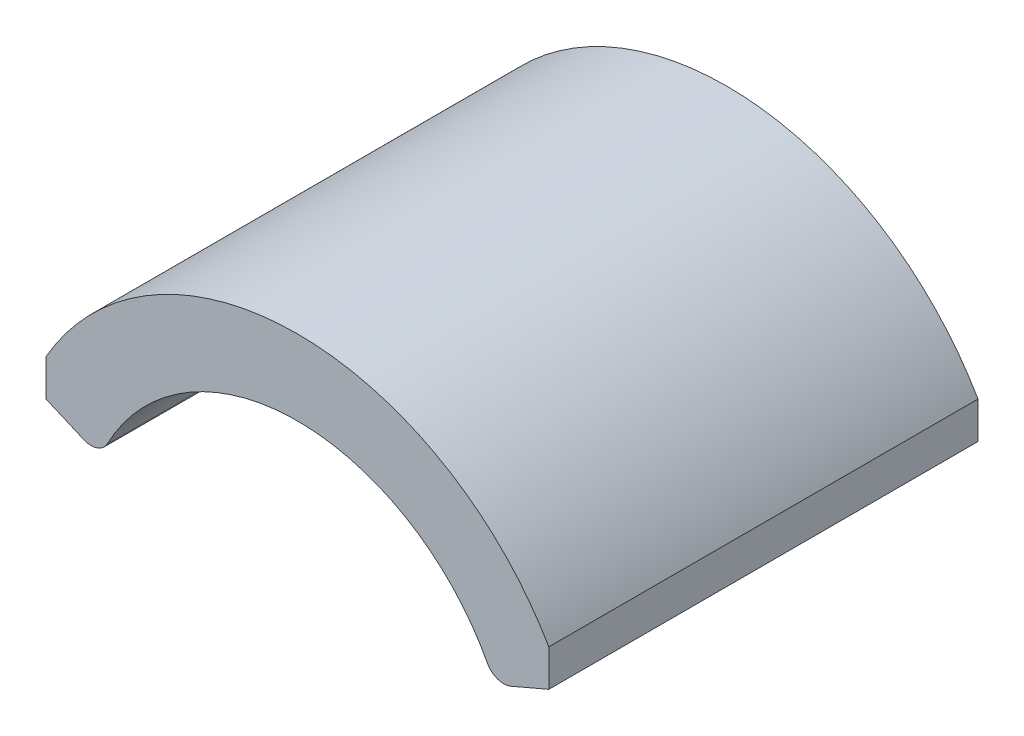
ISO-10303-21;
HEADER;
FILE_DESCRIPTION(('STEP AP214'),'2;1');
FILE_NAME('part.step','',(''),(''),'','','');
FILE_SCHEMA(('AUTOMOTIVE_DESIGN { 1 0 10303 214 1 1 1 1 }'));
ENDSEC;
DATA;
#1=APPLICATION_CONTEXT('core data for automotive mechanical design processes');
#2=APPLICATION_PROTOCOL_DEFINITION('international standard','automotive_design',2000,#1);
#3=PRODUCT_CONTEXT('',#1,'mechanical');
#4=PRODUCT('Part','Part','',(#3));
#5=PRODUCT_RELATED_PRODUCT_CATEGORY('part','',(#4));
#6=PRODUCT_DEFINITION_FORMATION('','',#4);
#7=PRODUCT_DEFINITION_CONTEXT('part definition',#1,'design');
#8=PRODUCT_DEFINITION('design','',#6,#7);
#9=PRODUCT_DEFINITION_SHAPE('','',#8);
#10=(LENGTH_UNIT() NAMED_UNIT(*) SI_UNIT(.MILLI.,.METRE.));
#11=(NAMED_UNIT(*) PLANE_ANGLE_UNIT() SI_UNIT($,.RADIAN.));
#12=(NAMED_UNIT(*) SI_UNIT($,.STERADIAN.) SOLID_ANGLE_UNIT());
#13=UNCERTAINTY_MEASURE_WITH_UNIT(LENGTH_MEASURE(1.E-05),#10,'distance_accuracy_value','');
#14=(GEOMETRIC_REPRESENTATION_CONTEXT(3) GLOBAL_UNCERTAINTY_ASSIGNED_CONTEXT((#13)) GLOBAL_UNIT_ASSIGNED_CONTEXT((#10,
#11,#12)) REPRESENTATION_CONTEXT('',''));
#15=CARTESIAN_POINT('',(0.,0.,0.));
#16=DIRECTION('',(0.,0.,1.));
#17=DIRECTION('',(1.,0.,0.));
#18=AXIS2_PLACEMENT_3D('',#15,#16,#17);
#19=CARTESIAN_POINT('',(0.,24.7771123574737,-50.));
#20=DIRECTION('',(0.,0.,1.));
#21=DIRECTION('',(1.,0.,0.));
#22=AXIS2_PLACEMENT_3D('',#19,#20,#21);
#23=CYLINDRICAL_SURFACE('',#22,23.6500000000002);
#24=CARTESIAN_POINT('',(0.,24.7771123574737,-15.));
#25=DIRECTION('',(0.,0.,1.));
#26=DIRECTION('',(1.,0.,0.));
#27=AXIS2_PLACEMENT_3D('',#24,#25,#26);
#28=CIRCLE('',#27,23.6500000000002);
#29=CARTESIAN_POINT('',(20.5,36.5700127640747,-15.));
#30=VERTEX_POINT('',#29);
#31=CARTESIAN_POINT('',(-20.5,36.5700127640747,-15.));
#32=VERTEX_POINT('',#31);
#33=EDGE_CURVE('E93',#30,#32,#28,.T.);
#34=ORIENTED_EDGE('',*,*,#33,.F.);
#35=DIRECTION('',(0.,0.,1.));
#36=VECTOR('',#35,1.);
#37=CARTESIAN_POINT('',(20.5,36.5700127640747,-50.));
#38=LINE('',#37,#36);
#39=CARTESIAN_POINT('',(20.5,36.5700127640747,-50.));
#40=VERTEX_POINT('',#39);
#41=EDGE_CURVE('E11',#40,#30,#38,.T.);
#42=ORIENTED_EDGE('',*,*,#41,.F.);
#43=CARTESIAN_POINT('',(0.,24.7771123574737,-50.));
#44=DIRECTION('',(0.,0.,1.));
#45=DIRECTION('',(1.,0.,0.));
#46=AXIS2_PLACEMENT_3D('',#43,#44,#45);
#47=CIRCLE('',#46,23.6500000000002);
#48=CARTESIAN_POINT('',(-20.5,36.5700127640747,-50.));
#49=VERTEX_POINT('',#48);
#50=EDGE_CURVE('E95',#40,#49,#47,.T.);
#51=ORIENTED_EDGE('',*,*,#50,.T.);
#52=DIRECTION('',(0.,0.,1.));
#53=VECTOR('',#52,1.);
#54=CARTESIAN_POINT('',(-20.5,36.5700127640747,-50.));
#55=LINE('',#54,#53);
#56=EDGE_CURVE('E32',#49,#32,#55,.T.);
#57=ORIENTED_EDGE('',*,*,#56,.T.);
#58=EDGE_LOOP('',(#34,#42,#51,#57));
#59=FACE_BOUND('',#58,.T.);
#60=ADVANCED_FACE('F29',(#59),#23,.T.);
#61=CARTESIAN_POINT('',(20.5,36.5700127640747,-50.));
#62=DIRECTION('',(1.,0.,0.));
#63=DIRECTION('',(0.,0.,-1.));
#64=AXIS2_PLACEMENT_3D('',#61,#62,#63);
#65=PLANE('',#64);
#66=DIRECTION('',(0.,1.,0.));
#67=VECTOR('',#66,1.);
#68=CARTESIAN_POINT('',(20.5,36.5700127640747,-15.));
#69=LINE('',#68,#67);
#70=CARTESIAN_POINT('',(20.5,33.5698113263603,-15.));
#71=VERTEX_POINT('',#70);
#72=EDGE_CURVE('E111',#71,#30,#69,.T.);
#73=ORIENTED_EDGE('',*,*,#72,.F.);
#74=DIRECTION('',(0.,0.,1.));
#75=VECTOR('',#74,1.);
#76=CARTESIAN_POINT('',(20.5,33.5698113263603,-50.));
#77=LINE('',#76,#75);
#78=CARTESIAN_POINT('',(20.5,33.5698113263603,-50.));
#79=VERTEX_POINT('',#78);
#80=EDGE_CURVE('E37',#79,#71,#77,.T.);
#81=ORIENTED_EDGE('',*,*,#80,.F.);
#82=DIRECTION('',(0.,1.,0.));
#83=VECTOR('',#82,1.);
#84=CARTESIAN_POINT('',(20.5,36.5700127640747,-50.));
#85=LINE('',#84,#83);
#86=EDGE_CURVE('E100',#79,#40,#85,.T.);
#87=ORIENTED_EDGE('',*,*,#86,.T.);
#88=ORIENTED_EDGE('',*,*,#41,.T.);
#89=EDGE_LOOP('',(#73,#81,#87,#88));
#90=FACE_BOUND('',#89,.T.);
#91=ADVANCED_FACE('F172',(#90),#65,.T.);
#92=CARTESIAN_POINT('',(17.4070993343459,32.2432286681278,-50.));
#93=DIRECTION('',(0.394183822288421,-0.919031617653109,0.));
#94=DIRECTION('',(0.919031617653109,0.394183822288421,0.));
#95=AXIS2_PLACEMENT_3D('',#92,#93,#94);
#96=PLANE('',#95);
#97=DIRECTION('',(0.919031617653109,0.394183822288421,0.));
#98=VECTOR('',#97,1.);
#99=CARTESIAN_POINT('',(17.4070993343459,32.2432286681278,-15.));
#100=LINE('',#99,#98);
#101=CARTESIAN_POINT('',(17.4070993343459,32.2432286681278,-15.));
#102=VERTEX_POINT('',#101);
#103=EDGE_CURVE('E124',#102,#71,#100,.T.);
#104=ORIENTED_EDGE('',*,*,#103,.F.);
#105=DIRECTION('',(0.,0.,1.));
#106=VECTOR('',#105,1.);
#107=CARTESIAN_POINT('',(17.4070993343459,32.2432286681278,-50.));
#108=LINE('',#107,#106);
#109=CARTESIAN_POINT('',(17.4070993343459,32.2432286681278,-50.));
#110=VERTEX_POINT('',#109);
#111=EDGE_CURVE('E146',#110,#102,#108,.T.);
#112=ORIENTED_EDGE('',*,*,#111,.F.);
#113=DIRECTION('',(0.919031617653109,0.394183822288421,0.));
#114=VECTOR('',#113,1.);
#115=CARTESIAN_POINT('',(17.4070993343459,32.2432286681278,-50.));
#116=LINE('',#115,#114);
#117=EDGE_CURVE('E142',#110,#79,#116,.T.);
#118=ORIENTED_EDGE('',*,*,#117,.T.);
#119=ORIENTED_EDGE('',*,*,#80,.T.);
#120=EDGE_LOOP('',(#104,#112,#118,#119));
#121=FACE_BOUND('',#120,.T.);
#122=ADVANCED_FACE('F171',(#121),#96,.T.);
#123=CARTESIAN_POINT('',(16.8158236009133,33.6217760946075,-50.));
#124=DIRECTION('',(0.,0.,1.));
#125=DIRECTION('',(1.,0.,0.));
#126=AXIS2_PLACEMENT_3D('',#123,#124,#125);
#127=CYLINDRICAL_SURFACE('',#126,1.5);
#128=CARTESIAN_POINT('',(16.8158236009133,33.6217760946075,-15.));
#129=DIRECTION('',(0.,0.,1.));
#130=DIRECTION('',(1.,0.,0.));
#131=AXIS2_PLACEMENT_3D('',#128,#129,#130);
#132=CIRCLE('',#131,1.5);
#133=CARTESIAN_POINT('',(15.4882585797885,32.9235131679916,-15.));
#134=VERTEX_POINT('',#133);
#135=EDGE_CURVE('E121',#134,#102,#132,.T.);
#136=ORIENTED_EDGE('',*,*,#135,.F.);
#137=DIRECTION('',(0.,0.,1.));
#138=VECTOR('',#137,1.);
#139=CARTESIAN_POINT('',(15.4882585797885,32.9235131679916,-50.));
#140=LINE('',#139,#138);
#141=CARTESIAN_POINT('',(15.4882585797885,32.9235131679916,-50.));
#142=VERTEX_POINT('',#141);
#143=EDGE_CURVE('E148',#142,#134,#140,.T.);
#144=ORIENTED_EDGE('',*,*,#143,.F.);
#145=CARTESIAN_POINT('',(16.8158236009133,33.6217760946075,-50.));
#146=DIRECTION('',(0.,0.,1.));
#147=DIRECTION('',(1.,0.,0.));
#148=AXIS2_PLACEMENT_3D('',#145,#146,#147);
#149=CIRCLE('',#148,1.5);
#150=EDGE_CURVE('E139',#142,#110,#149,.T.);
#151=ORIENTED_EDGE('',*,*,#150,.T.);
#152=ORIENTED_EDGE('',*,*,#111,.T.);
#153=EDGE_LOOP('',(#136,#144,#151,#152));
#154=FACE_BOUND('',#153,.T.);
#155=ADVANCED_FACE('F167',(#154),#127,.T.);
#156=CARTESIAN_POINT('',(0.,24.7771123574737,-50.));
#157=DIRECTION('',(0.,0.,1.));
#158=DIRECTION('',(1.,0.,0.));
#159=AXIS2_PLACEMENT_3D('',#156,#157,#158);
#160=CYLINDRICAL_SURFACE('',#159,17.5);
#161=CARTESIAN_POINT('',(0.,24.7771123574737,-15.));
#162=DIRECTION('',(0.,0.,-1.));
#163=DIRECTION('',(1.,0.,0.));
#164=AXIS2_PLACEMENT_3D('',#161,#162,#163);
#165=CIRCLE('',#164,17.5);
#166=CARTESIAN_POINT('',(-15.4882585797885,32.9235131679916,-15.));
#167=VERTEX_POINT('',#166);
#168=EDGE_CURVE('E118',#167,#134,#165,.T.);
#169=ORIENTED_EDGE('',*,*,#168,.F.);
#170=DIRECTION('',(0.,0.,1.));
#171=VECTOR('',#170,1.);
#172=CARTESIAN_POINT('',(-15.4882585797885,32.9235131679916,-50.));
#173=LINE('',#172,#171);
#174=CARTESIAN_POINT('',(-15.4882585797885,32.9235131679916,-50.));
#175=VERTEX_POINT('',#174);
#176=EDGE_CURVE('E150',#175,#167,#173,.T.);
#177=ORIENTED_EDGE('',*,*,#176,.F.);
#178=CARTESIAN_POINT('',(0.,24.7771123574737,-50.));
#179=DIRECTION('',(0.,0.,-1.));
#180=DIRECTION('',(1.,0.,0.));
#181=AXIS2_PLACEMENT_3D('',#178,#179,#180);
#182=CIRCLE('',#181,17.5);
#183=EDGE_CURVE('E136',#175,#142,#182,.T.);
#184=ORIENTED_EDGE('',*,*,#183,.T.);
#185=ORIENTED_EDGE('',*,*,#143,.T.);
#186=EDGE_LOOP('',(#169,#177,#184,#185));
#187=FACE_BOUND('',#186,.T.);
#188=ADVANCED_FACE('F163',(#187),#160,.F.);
#189=CARTESIAN_POINT('',(-16.8158236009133,33.6217760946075,-50.));
#190=DIRECTION('',(0.,0.,1.));
#191=DIRECTION('',(1.,0.,0.));
#192=AXIS2_PLACEMENT_3D('',#189,#190,#191);
#193=CYLINDRICAL_SURFACE('',#192,1.5);
#194=CARTESIAN_POINT('',(-16.8158236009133,33.6217760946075,-15.));
#195=DIRECTION('',(0.,0.,1.));
#196=DIRECTION('',(-1.,0.,0.));
#197=AXIS2_PLACEMENT_3D('',#194,#195,#196);
#198=CIRCLE('',#197,1.5);
#199=CARTESIAN_POINT('',(-17.4070993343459,32.2432286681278,-15.));
#200=VERTEX_POINT('',#199);
#201=EDGE_CURVE('E115',#200,#167,#198,.T.);
#202=ORIENTED_EDGE('',*,*,#201,.F.);
#203=DIRECTION('',(0.,0.,1.));
#204=VECTOR('',#203,1.);
#205=CARTESIAN_POINT('',(-17.4070993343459,32.2432286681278,-50.));
#206=LINE('',#205,#204);
#207=CARTESIAN_POINT('',(-17.4070993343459,32.2432286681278,-50.));
#208=VERTEX_POINT('',#207);
#209=EDGE_CURVE('E152',#208,#200,#206,.T.);
#210=ORIENTED_EDGE('',*,*,#209,.F.);
#211=CARTESIAN_POINT('',(-16.8158236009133,33.6217760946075,-50.));
#212=DIRECTION('',(0.,0.,1.));
#213=DIRECTION('',(-1.,0.,0.));
#214=AXIS2_PLACEMENT_3D('',#211,#212,#213);
#215=CIRCLE('',#214,1.5);
#216=EDGE_CURVE('E133',#208,#175,#215,.T.);
#217=ORIENTED_EDGE('',*,*,#216,.T.);
#218=ORIENTED_EDGE('',*,*,#176,.T.);
#219=EDGE_LOOP('',(#202,#210,#217,#218));
#220=FACE_BOUND('',#219,.T.);
#221=ADVANCED_FACE('F159',(#220),#193,.T.);
#222=CARTESIAN_POINT('',(-17.4070993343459,32.2432286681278,-50.));
#223=DIRECTION('',(-0.394183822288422,-0.919031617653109,0.));
#224=DIRECTION('',(0.919031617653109,-0.394183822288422,0.));
#225=AXIS2_PLACEMENT_3D('',#222,#223,#224);
#226=PLANE('',#225);
#227=DIRECTION('',(0.919031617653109,-0.394183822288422,0.));
#228=VECTOR('',#227,1.);
#229=CARTESIAN_POINT('',(-17.4070993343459,32.2432286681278,-15.));
#230=LINE('',#229,#228);
#231=CARTESIAN_POINT('',(-20.5,33.5698113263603,-15.));
#232=VERTEX_POINT('',#231);
#233=EDGE_CURVE('E107',#232,#200,#230,.T.);
#234=ORIENTED_EDGE('',*,*,#233,.F.);
#235=DIRECTION('',(0.,0.,1.));
#236=VECTOR('',#235,1.);
#237=CARTESIAN_POINT('',(-20.5,33.5698113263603,-50.));
#238=LINE('',#237,#236);
#239=CARTESIAN_POINT('',(-20.5,33.5698113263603,-50.));
#240=VERTEX_POINT('',#239);
#241=EDGE_CURVE('E99',#240,#232,#238,.T.);
#242=ORIENTED_EDGE('',*,*,#241,.F.);
#243=DIRECTION('',(0.919031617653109,-0.394183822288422,0.));
#244=VECTOR('',#243,1.);
#245=CARTESIAN_POINT('',(-17.4070993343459,32.2432286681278,-50.));
#246=LINE('',#245,#244);
#247=EDGE_CURVE('E130',#240,#208,#246,.T.);
#248=ORIENTED_EDGE('',*,*,#247,.T.);
#249=ORIENTED_EDGE('',*,*,#209,.T.);
#250=EDGE_LOOP('',(#234,#242,#248,#249));
#251=FACE_BOUND('',#250,.T.);
#252=ADVANCED_FACE('F155',(#251),#226,.T.);
#253=CARTESIAN_POINT('',(-20.5,36.5700127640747,-50.));
#254=DIRECTION('',(-1.,0.,0.));
#255=DIRECTION('',(0.,-1.,0.));
#256=AXIS2_PLACEMENT_3D('',#253,#254,#255);
#257=PLANE('',#256);
#258=DIRECTION('',(0.,-1.,0.));
#259=VECTOR('',#258,1.);
#260=CARTESIAN_POINT('',(-20.5,36.5700127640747,-15.));
#261=LINE('',#260,#259);
#262=EDGE_CURVE('E102',#32,#232,#261,.T.);
#263=ORIENTED_EDGE('',*,*,#262,.F.);
#264=ORIENTED_EDGE('',*,*,#56,.F.);
#265=DIRECTION('',(0.,-1.,0.));
#266=VECTOR('',#265,1.);
#267=CARTESIAN_POINT('',(-20.5,36.5700127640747,-50.));
#268=LINE('',#267,#266);
#269=EDGE_CURVE('E128',#49,#240,#268,.T.);
#270=ORIENTED_EDGE('',*,*,#269,.T.);
#271=ORIENTED_EDGE('',*,*,#241,.T.);
#272=EDGE_LOOP('',(#263,#264,#270,#271));
#273=FACE_BOUND('',#272,.T.);
#274=ADVANCED_FACE('F103',(#273),#257,.T.);
#275=CARTESIAN_POINT('',(0.,24.7771123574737,-50.));
#276=DIRECTION('',(0.,0.,1.));
#277=DIRECTION('',(1.,0.,0.));
#278=AXIS2_PLACEMENT_3D('',#275,#276,#277);
#279=PLANE('',#278);
#280=ORIENTED_EDGE('',*,*,#50,.F.);
#281=ORIENTED_EDGE('',*,*,#86,.F.);
#282=ORIENTED_EDGE('',*,*,#117,.F.);
#283=ORIENTED_EDGE('',*,*,#150,.F.);
#284=ORIENTED_EDGE('',*,*,#183,.F.);
#285=ORIENTED_EDGE('',*,*,#216,.F.);
#286=ORIENTED_EDGE('',*,*,#247,.F.);
#287=ORIENTED_EDGE('',*,*,#269,.F.);
#288=EDGE_LOOP('',(#280,#281,#282,#283,#284,#285,#286,#287));
#289=FACE_BOUND('',#288,.T.);
#290=ADVANCED_FACE('F175',(#289),#279,.F.);
#291=CARTESIAN_POINT('',(0.,24.7771123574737,-15.));
#292=DIRECTION('',(0.,0.,1.));
#293=DIRECTION('',(1.,0.,0.));
#294=AXIS2_PLACEMENT_3D('',#291,#292,#293);
#295=PLANE('',#294);
#296=ORIENTED_EDGE('',*,*,#33,.T.);
#297=ORIENTED_EDGE('',*,*,#262,.T.);
#298=ORIENTED_EDGE('',*,*,#233,.T.);
#299=ORIENTED_EDGE('',*,*,#201,.T.);
#300=ORIENTED_EDGE('',*,*,#168,.T.);
#301=ORIENTED_EDGE('',*,*,#135,.T.);
#302=ORIENTED_EDGE('',*,*,#103,.T.);
#303=ORIENTED_EDGE('',*,*,#72,.T.);
#304=EDGE_LOOP('',(#296,#297,#298,#299,#300,#301,#302,#303));
#305=FACE_BOUND('',#304,.T.);
#306=ADVANCED_FACE('F109',(#305),#295,.T.);
#307=CLOSED_SHELL('',(#60,#91,#122,#155,#188,#221,#252,#274,#290,#306));
#308=MANIFOLD_SOLID_BREP('B2',#307);
#309=ADVANCED_BREP_SHAPE_REPRESENTATION('',(#18,#308),#14);
#310=SHAPE_DEFINITION_REPRESENTATION(#9,#309);
ENDSEC;
END-ISO-10303-21;
